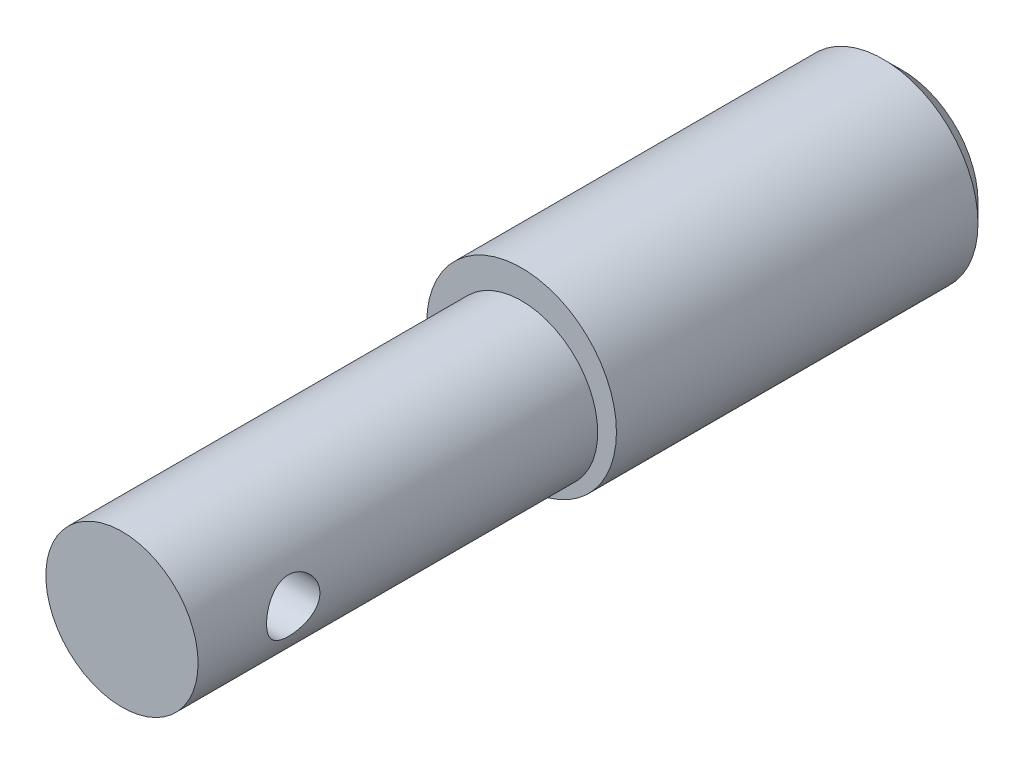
ISO-10303-21;
HEADER;
FILE_DESCRIPTION(('STEP AP214'),'2;1');
FILE_NAME('part.step','',(''),(''),'','','');
FILE_SCHEMA(('AUTOMOTIVE_DESIGN { 1 0 10303 214 1 1 1 1 }'));
ENDSEC;
DATA;
#1=APPLICATION_CONTEXT('core data for automotive mechanical design processes');
#2=APPLICATION_PROTOCOL_DEFINITION('international standard','automotive_design',2000,#1);
#3=PRODUCT_CONTEXT('',#1,'mechanical');
#4=PRODUCT('Part','Part','',(#3));
#5=PRODUCT_RELATED_PRODUCT_CATEGORY('part','',(#4));
#6=PRODUCT_DEFINITION_FORMATION('','',#4);
#7=PRODUCT_DEFINITION_CONTEXT('part definition',#1,'design');
#8=PRODUCT_DEFINITION('design','',#6,#7);
#9=PRODUCT_DEFINITION_SHAPE('','',#8);
#10=(LENGTH_UNIT() NAMED_UNIT(*) SI_UNIT(.MILLI.,.METRE.));
#11=(NAMED_UNIT(*) PLANE_ANGLE_UNIT() SI_UNIT($,.RADIAN.));
#12=(NAMED_UNIT(*) SI_UNIT($,.STERADIAN.) SOLID_ANGLE_UNIT());
#13=UNCERTAINTY_MEASURE_WITH_UNIT(LENGTH_MEASURE(1.E-05),#10,'distance_accuracy_value','');
#14=(GEOMETRIC_REPRESENTATION_CONTEXT(3) GLOBAL_UNCERTAINTY_ASSIGNED_CONTEXT((#13)) GLOBAL_UNIT_ASSIGNED_CONTEXT((#10,
#11,#12)) REPRESENTATION_CONTEXT('',''));
#15=CARTESIAN_POINT('',(0.,0.,0.));
#16=DIRECTION('',(0.,0.,1.));
#17=DIRECTION('',(1.,0.,0.));
#18=AXIS2_PLACEMENT_3D('',#15,#16,#17);
#19=CARTESIAN_POINT('',(0.,0.,16.271875));
#20=DIRECTION('',(0.,0.,-1.));
#21=DIRECTION('',(-1.,0.,0.));
#22=AXIS2_PLACEMENT_3D('',#19,#20,#21);
#23=CYLINDRICAL_SURFACE('',#22,3.95605);
#24=CARTESIAN_POINT('',(0.,0.,-0.396874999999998));
#25=DIRECTION('',(0.,0.,-1.));
#26=DIRECTION('',(-1.,0.,0.));
#27=AXIS2_PLACEMENT_3D('',#24,#25,#26);
#28=CIRCLE('',#27,3.95605);
#29=CARTESIAN_POINT('',(-3.95605,0.,-0.396874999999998));
#30=VERTEX_POINT('',#29);
#31=EDGE_CURVE('E54',#30,#30,#28,.T.);
#32=ORIENTED_EDGE('',*,*,#31,.T.);
#33=EDGE_LOOP('',(#32));
#34=FACE_BOUND('',#33,.T.);
#35=CARTESIAN_POINT('',(0.,0.,-15.478125));
#36=DIRECTION('',(0.,0.,1.));
#37=DIRECTION('',(1.,0.,0.));
#38=AXIS2_PLACEMENT_3D('',#35,#36,#37);
#39=CIRCLE('',#38,3.95605);
#40=CARTESIAN_POINT('',(3.95605,0.,-15.478125));
#41=VERTEX_POINT('',#40);
#42=EDGE_CURVE('E49',#41,#41,#39,.T.);
#43=ORIENTED_EDGE('',*,*,#42,.T.);
#44=EDGE_LOOP('',(#43));
#45=FACE_BOUND('',#44,.T.);
#46=ADVANCED_FACE('F36',(#34,#45),#23,.T.);
#47=CARTESIAN_POINT('',(0.,0.,-16.271875));
#48=DIRECTION('',(0.,0.,1.));
#49=DIRECTION('',(1.,0.,0.));
#50=AXIS2_PLACEMENT_3D('',#47,#48,#49);
#51=PLANE('',#50);
#52=CARTESIAN_POINT('',(0.,0.,-16.271875));
#53=DIRECTION('',(0.,0.,1.));
#54=DIRECTION('',(1.,0.,0.));
#55=AXIS2_PLACEMENT_3D('',#52,#53,#54);
#56=CIRCLE('',#55,3.16229999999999);
#57=CARTESIAN_POINT('',(3.16229999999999,0.,-16.271875));
#58=VERTEX_POINT('',#57);
#59=EDGE_CURVE('E11',#58,#58,#56,.F.);
#60=ORIENTED_EDGE('',*,*,#59,.T.);
#61=EDGE_LOOP('',(#60));
#62=FACE_BOUND('',#61,.T.);
#63=ADVANCED_FACE('F83',(#62),#51,.F.);
#64=CARTESIAN_POINT('',(0.,0.,-15.478125));
#65=DIRECTION('',(0.,0.,1.));
#66=DIRECTION('',(1.,0.,0.));
#67=AXIS2_PLACEMENT_3D('',#64,#65,#66);
#68=CONICAL_SURFACE('',#67,3.95605,0.785398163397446);
#69=ORIENTED_EDGE('',*,*,#59,.F.);
#70=EDGE_LOOP('',(#69));
#71=FACE_BOUND('',#70,.T.);
#72=ORIENTED_EDGE('',*,*,#42,.F.);
#73=EDGE_LOOP('',(#72));
#74=FACE_BOUND('',#73,.T.);
#75=ADVANCED_FACE('F38',(#71,#74),#68,.T.);
#76=CARTESIAN_POINT('',(0.,3.95605,-0.396874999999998));
#77=DIRECTION('',(0.,0.,-1.));
#78=DIRECTION('',(-1.,0.,0.));
#79=AXIS2_PLACEMENT_3D('',#76,#77,#78);
#80=PLANE('',#79);
#81=CARTESIAN_POINT('',(0.,-0.4064,-0.396874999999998));
#82=DIRECTION('',(0.,0.,1.));
#83=DIRECTION('',(1.,0.,0.));
#84=AXIS2_PLACEMENT_3D('',#81,#82,#83);
#85=CIRCLE('',#84,3.175);
#86=CARTESIAN_POINT('',(3.175,-0.4064,-0.396874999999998));
#87=VERTEX_POINT('',#86);
#88=EDGE_CURVE('E59',#87,#87,#85,.T.);
#89=ORIENTED_EDGE('',*,*,#88,.F.);
#90=EDGE_LOOP('',(#89));
#91=FACE_BOUND('',#90,.T.);
#92=ORIENTED_EDGE('',*,*,#31,.F.);
#93=EDGE_LOOP('',(#92));
#94=FACE_BOUND('',#93,.T.);
#95=ADVANCED_FACE('F92',(#91,#94),#80,.F.);
#96=CARTESIAN_POINT('',(0.,-0.4064,13.5155963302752));
#97=DIRECTION('',(0.,0.,1.));
#98=DIRECTION('',(1.,0.,0.));
#99=AXIS2_PLACEMENT_3D('',#96,#97,#98);
#100=CYLINDRICAL_SURFACE('',#99,3.175);
#101=CARTESIAN_POINT('',(3.175,-0.4064,11.1909716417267));
#102=CARTESIAN_POINT('',(3.17500066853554,-0.345895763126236,11.1909706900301));
#103=CARTESIAN_POINT('',(3.17325490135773,-0.285398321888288,11.1959248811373));
#104=CARTESIAN_POINT('',(3.16646357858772,-0.166195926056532,11.215542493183));
#105=CARTESIAN_POINT('',(3.16141801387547,-0.107490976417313,11.2302059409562));
#106=CARTESIAN_POINT('',(3.14857274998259,0.00639074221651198,11.2686703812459));
#107=CARTESIAN_POINT('',(3.14077794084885,0.0615735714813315,11.2924551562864));
#108=CARTESIAN_POINT('',(3.12322210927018,0.167165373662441,11.3484101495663));
#109=CARTESIAN_POINT('',(3.11346063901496,0.217573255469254,11.3805822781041));
#110=CARTESIAN_POINT('',(3.09257883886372,0.314088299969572,11.4536723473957));
#111=CARTESIAN_POINT('',(3.08142355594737,0.359990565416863,11.4948507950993));
#112=CARTESIAN_POINT('',(3.05919544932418,0.44439780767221,11.5842311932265));
#113=CARTESIAN_POINT('',(3.04812264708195,0.482900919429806,11.6324349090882));
#114=CARTESIAN_POINT('',(3.02692009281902,0.552638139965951,11.7364037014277));
#115=CARTESIAN_POINT('',(3.01683242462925,0.583596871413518,11.7923629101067));
#116=CARTESIAN_POINT('',(2.99927864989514,0.635574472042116,11.9091037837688));
#117=CARTESIAN_POINT('',(2.99181164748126,0.656596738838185,11.969883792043));
#118=CARTESIAN_POINT('',(2.98071488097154,0.687319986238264,12.0921981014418));
#119=CARTESIAN_POINT('',(2.9769544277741,0.697407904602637,12.1536229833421));
#120=CARTESIAN_POINT('',(2.97331146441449,0.707186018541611,12.2773998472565));
#121=CARTESIAN_POINT('',(2.97342760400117,0.706879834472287,12.3397514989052));
#122=CARTESIAN_POINT('',(2.97741089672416,0.696177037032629,12.4602211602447));
#123=CARTESIAN_POINT('',(2.98108587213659,0.68629737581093,12.5183925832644));
#124=CARTESIAN_POINT('',(2.99145635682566,0.65757583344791,12.6321928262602));
#125=CARTESIAN_POINT('',(2.99815226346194,0.638732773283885,12.6878213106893));
#126=CARTESIAN_POINT('',(3.01393852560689,0.592302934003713,12.7960829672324));
#127=CARTESIAN_POINT('',(3.02306827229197,0.564570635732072,12.8486477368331));
#128=CARTESIAN_POINT('',(3.04267834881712,0.501250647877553,12.948535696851));
#129=CARTESIAN_POINT('',(3.05315909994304,0.465660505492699,12.9958572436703));
#130=CARTESIAN_POINT('',(3.07503338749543,0.385198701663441,13.08680395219));
#131=CARTESIAN_POINT('',(3.08644459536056,0.339908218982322,13.1300551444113));
#132=CARTESIAN_POINT('',(3.10836554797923,0.242579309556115,13.2084514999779));
#133=CARTESIAN_POINT('',(3.1188751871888,0.190540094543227,13.2435957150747));
#134=CARTESIAN_POINT('',(3.13797296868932,0.0803348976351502,13.3051242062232));
#135=CARTESIAN_POINT('',(3.14653664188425,0.022103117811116,13.331398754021));
#136=CARTESIAN_POINT('',(3.16059865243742,-0.0983269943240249,13.3736594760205));
#137=CARTESIAN_POINT('',(3.16609817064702,-0.160523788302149,13.3896496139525));
#138=CARTESIAN_POINT('',(3.17321186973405,-0.283959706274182,13.4102029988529));
#139=CARTESIAN_POINT('',(3.17499748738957,-0.345105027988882,13.4152708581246));
#140=CARTESIAN_POINT('',(3.17500250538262,-0.467390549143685,13.4152858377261));
#141=CARTESIAN_POINT('',(3.17322257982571,-0.528530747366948,13.4102348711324));
#142=CARTESIAN_POINT('',(3.16640981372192,-0.646987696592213,13.3905491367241));
#143=CARTESIAN_POINT('',(3.1614849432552,-0.704364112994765,13.3762322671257));
#144=CARTESIAN_POINT('',(3.14898536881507,-0.81587100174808,13.338826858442));
#145=CARTESIAN_POINT('',(3.14141032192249,-0.870001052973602,13.3157371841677));
#146=CARTESIAN_POINT('',(3.12411016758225,-0.975153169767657,13.260738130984));
#147=CARTESIAN_POINT('',(3.11433132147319,-1.0260476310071,13.228602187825));
#148=CARTESIAN_POINT('',(3.09372246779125,-1.12188088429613,13.1566846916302));
#149=CARTESIAN_POINT('',(3.08289211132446,-1.16681768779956,13.1169005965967));
#150=CARTESIAN_POINT('',(3.0607046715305,-1.25182272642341,13.0284484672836));
#151=CARTESIAN_POINT('',(3.04934856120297,-1.29153128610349,12.979433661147));
#152=CARTESIAN_POINT('',(3.02793851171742,-1.36221462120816,12.8751987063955));
#153=CARTESIAN_POINT('',(3.0178846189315,-1.39318908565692,12.8199783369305));
#154=CARTESIAN_POINT('',(3.00029780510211,-1.44543921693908,12.7047269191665));
#155=CARTESIAN_POINT('',(2.99276503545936,-1.46671430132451,12.6446955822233));
#156=CARTESIAN_POINT('',(2.98122687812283,-1.49874001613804,12.5215720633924));
#157=CARTESIAN_POINT('',(2.97721967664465,-1.5094960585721,12.4584814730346));
#158=CARTESIAN_POINT('',(2.97340669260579,-1.51973035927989,12.334870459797));
#159=CARTESIAN_POINT('',(2.97337616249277,-1.51981190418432,12.274406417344));
#160=CARTESIAN_POINT('',(2.97695615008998,-1.51020377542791,12.1543752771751));
#161=CARTESIAN_POINT('',(2.9805664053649,-1.50051480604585,12.0948081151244));
#162=CARTESIAN_POINT('',(2.99084566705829,-1.47208569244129,11.9796486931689));
#163=CARTESIAN_POINT('',(2.99744178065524,-1.45356071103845,11.9239962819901));
#164=CARTESIAN_POINT('',(3.01291616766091,-1.40816518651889,11.816549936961));
#165=CARTESIAN_POINT('',(3.02179497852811,-1.3812926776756,11.7647569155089));
#166=CARTESIAN_POINT('',(3.04135727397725,-1.31848553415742,11.6638423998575));
#167=CARTESIAN_POINT('',(3.05210623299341,-1.28218253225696,11.6149629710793));
#168=CARTESIAN_POINT('',(3.07394393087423,-1.20214652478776,11.5237956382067));
#169=CARTESIAN_POINT('',(3.08503276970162,-1.15841131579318,11.4815096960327));
#170=CARTESIAN_POINT('',(3.10689632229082,-1.0624079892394,11.4028142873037));
#171=CARTESIAN_POINT('',(3.11763481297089,-1.00984574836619,11.3667521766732));
#172=CARTESIAN_POINT('',(3.13705096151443,-0.899040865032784,11.3040044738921));
#173=CARTESIAN_POINT('',(3.14572888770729,-0.840798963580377,11.2773176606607));
#174=CARTESIAN_POINT('',(3.15995884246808,-0.720868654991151,11.2344782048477));
#175=CARTESIAN_POINT('',(3.16554201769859,-0.659221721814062,11.2182203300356));
#176=CARTESIAN_POINT('',(3.17306159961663,-0.533846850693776,11.1964694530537));
#177=CARTESIAN_POINT('',(3.174999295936,-0.470119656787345,11.190972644));
#178=CARTESIAN_POINT('',(3.175,-0.4064,11.1909716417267));
#179=B_SPLINE_CURVE_WITH_KNOTS('',3,(#101,#102,#103,#104,#105,#106,#107,#108,#109,#110,#111,
#112,#113,#114,#115,#116,#117,#118,#119,#120,#121,#122,#123,#124,#125,#126,#127,#128,#129,#130,
#131,#132,#133,#134,#135,#136,#137,#138,#139,#140,#141,#142,#143,#144,#145,#146,#147,#148,#149,
#150,#151,#152,#153,#154,#155,#156,#157,#158,#159,#160,#161,#162,#163,#164,#165,#166,#167,#168,
#169,#170,#171,#172,#173,#174,#175,#176,#177,#178),.UNSPECIFIED.,.T.,.F.,(4,2,2,2,2,2,2,2,2,2,2,
2,2,2,2,2,2,2,2,2,2,2,2,2,2,2,2,2,2,2,2,2,2,2,2,2,2,2,4),(0.,0.181278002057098,
0.362556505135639,0.54351418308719,0.724513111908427,0.911675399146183,1.09888480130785,
1.29214909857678,1.48534726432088,1.67145977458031,1.85750746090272,2.03403833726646,
2.21059244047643,2.39019858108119,2.56986086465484,2.75995117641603,2.95006371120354,
3.14244865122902,3.33475939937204,3.51797588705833,3.70115773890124,3.87836604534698,
4.05559729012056,4.23773725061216,4.41993785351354,4.61132433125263,4.80271762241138,
4.99412240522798,5.18542865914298,5.3659179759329,5.54639428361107,5.72268428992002,
5.89901584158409,6.0836838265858,6.26840665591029,6.46139015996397,6.65434851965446,
6.84532788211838,7.03623967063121),.UNSPECIFIED.);
#180=CARTESIAN_POINT('',(3.175,-0.4064,11.1909716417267));
#181=VERTEX_POINT('',#180);
#182=EDGE_CURVE('E40',#181,#181,#179,.T.);
#183=ORIENTED_EDGE('',*,*,#182,.F.);
#184=EDGE_LOOP('',(#183));
#185=FACE_BOUND('',#184,.T.);
#186=CARTESIAN_POINT('',(-3.175,-0.4064,11.1909716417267));
#187=CARTESIAN_POINT('',(-3.17500066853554,-0.466904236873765,11.1909706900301));
#188=CARTESIAN_POINT('',(-3.17325490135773,-0.527401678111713,11.1959248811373));
#189=CARTESIAN_POINT('',(-3.16646357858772,-0.646604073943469,11.215542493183));
#190=CARTESIAN_POINT('',(-3.16141801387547,-0.705309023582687,11.2302059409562));
#191=CARTESIAN_POINT('',(-3.14857274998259,-0.819190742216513,11.2686703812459));
#192=CARTESIAN_POINT('',(-3.14077794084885,-0.874373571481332,11.2924551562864));
#193=CARTESIAN_POINT('',(-3.12322210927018,-0.979965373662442,11.3484101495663));
#194=CARTESIAN_POINT('',(-3.11346063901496,-1.03037325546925,11.3805822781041));
#195=CARTESIAN_POINT('',(-3.09257883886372,-1.12688829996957,11.4536723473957));
#196=CARTESIAN_POINT('',(-3.08142355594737,-1.17279056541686,11.4948507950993));
#197=CARTESIAN_POINT('',(-3.05919544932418,-1.25719780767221,11.5842311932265));
#198=CARTESIAN_POINT('',(-3.04812264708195,-1.29570091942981,11.6324349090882));
#199=CARTESIAN_POINT('',(-3.02692009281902,-1.36543813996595,11.7364037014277));
#200=CARTESIAN_POINT('',(-3.01683242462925,-1.39639687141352,11.7923629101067));
#201=CARTESIAN_POINT('',(-2.99927864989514,-1.44837447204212,11.9091037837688));
#202=CARTESIAN_POINT('',(-2.99181164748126,-1.46939673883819,11.969883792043));
#203=CARTESIAN_POINT('',(-2.98071488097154,-1.50011998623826,12.0921981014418));
#204=CARTESIAN_POINT('',(-2.9769544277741,-1.51020790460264,12.1536229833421));
#205=CARTESIAN_POINT('',(-2.97331146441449,-1.51998601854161,12.2773998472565));
#206=CARTESIAN_POINT('',(-2.97342760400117,-1.51967983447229,12.3397514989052));
#207=CARTESIAN_POINT('',(-2.97741089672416,-1.50897703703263,12.4602211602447));
#208=CARTESIAN_POINT('',(-2.98108587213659,-1.49909737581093,12.5183925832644));
#209=CARTESIAN_POINT('',(-2.99145635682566,-1.47037583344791,12.6321928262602));
#210=CARTESIAN_POINT('',(-2.99815226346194,-1.45153277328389,12.6878213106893));
#211=CARTESIAN_POINT('',(-3.01393852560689,-1.40510293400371,12.7960829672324));
#212=CARTESIAN_POINT('',(-3.02306827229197,-1.37737063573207,12.8486477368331));
#213=CARTESIAN_POINT('',(-3.04267834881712,-1.31405064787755,12.948535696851));
#214=CARTESIAN_POINT('',(-3.05315909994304,-1.2784605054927,12.9958572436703));
#215=CARTESIAN_POINT('',(-3.07503338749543,-1.19799870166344,13.08680395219));
#216=CARTESIAN_POINT('',(-3.08644459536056,-1.15270821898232,13.1300551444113));
#217=CARTESIAN_POINT('',(-3.10836554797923,-1.05537930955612,13.2084514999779));
#218=CARTESIAN_POINT('',(-3.1188751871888,-1.00334009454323,13.2435957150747));
#219=CARTESIAN_POINT('',(-3.13797296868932,-0.893134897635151,13.3051242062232));
#220=CARTESIAN_POINT('',(-3.14653664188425,-0.834903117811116,13.331398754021));
#221=CARTESIAN_POINT('',(-3.16059865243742,-0.714473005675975,13.3736594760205));
#222=CARTESIAN_POINT('',(-3.16609817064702,-0.652276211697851,13.3896496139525));
#223=CARTESIAN_POINT('',(-3.17321186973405,-0.528840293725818,13.4102029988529));
#224=CARTESIAN_POINT('',(-3.17499748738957,-0.467694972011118,13.4152708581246));
#225=CARTESIAN_POINT('',(-3.17500250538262,-0.345409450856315,13.4152858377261));
#226=CARTESIAN_POINT('',(-3.17322257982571,-0.284269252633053,13.4102348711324));
#227=CARTESIAN_POINT('',(-3.16640981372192,-0.165812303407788,13.3905491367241));
#228=CARTESIAN_POINT('',(-3.1614849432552,-0.108435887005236,13.3762322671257));
#229=CARTESIAN_POINT('',(-3.14898536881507,0.00307100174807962,13.338826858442));
#230=CARTESIAN_POINT('',(-3.14141032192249,0.0572010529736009,13.3157371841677));
#231=CARTESIAN_POINT('',(-3.12411016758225,0.162353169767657,13.260738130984));
#232=CARTESIAN_POINT('',(-3.11433132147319,0.213247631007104,13.228602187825));
#233=CARTESIAN_POINT('',(-3.09372246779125,0.309080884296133,13.1566846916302));
#234=CARTESIAN_POINT('',(-3.08289211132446,0.354017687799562,13.1169005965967));
#235=CARTESIAN_POINT('',(-3.0607046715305,0.439022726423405,13.0284484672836));
#236=CARTESIAN_POINT('',(-3.04934856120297,0.478731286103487,12.979433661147));
#237=CARTESIAN_POINT('',(-3.02793851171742,0.549414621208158,12.8751987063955));
#238=CARTESIAN_POINT('',(-3.0178846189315,0.580389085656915,12.8199783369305));
#239=CARTESIAN_POINT('',(-3.00029780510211,0.63263921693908,12.7047269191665));
#240=CARTESIAN_POINT('',(-2.99276503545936,0.653914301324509,12.6446955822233));
#241=CARTESIAN_POINT('',(-2.98122687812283,0.685940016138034,12.5215720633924));
#242=CARTESIAN_POINT('',(-2.97721967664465,0.696696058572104,12.4584814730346));
#243=CARTESIAN_POINT('',(-2.97340669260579,0.706930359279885,12.334870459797));
#244=CARTESIAN_POINT('',(-2.97337616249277,0.707011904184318,12.274406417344));
#245=CARTESIAN_POINT('',(-2.97695615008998,0.697403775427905,12.1543752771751));
#246=CARTESIAN_POINT('',(-2.9805664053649,0.687714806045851,12.0948081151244));
#247=CARTESIAN_POINT('',(-2.99084566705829,0.659285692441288,11.9796486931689));
#248=CARTESIAN_POINT('',(-2.99744178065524,0.64076071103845,11.9239962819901));
#249=CARTESIAN_POINT('',(-3.01291616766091,0.595365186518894,11.816549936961));
#250=CARTESIAN_POINT('',(-3.02179497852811,0.568492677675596,11.7647569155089));
#251=CARTESIAN_POINT('',(-3.04135727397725,0.50568553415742,11.6638423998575));
#252=CARTESIAN_POINT('',(-3.05210623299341,0.46938253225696,11.6149629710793));
#253=CARTESIAN_POINT('',(-3.07394393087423,0.38934652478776,11.5237956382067));
#254=CARTESIAN_POINT('',(-3.08503276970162,0.345611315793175,11.4815096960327));
#255=CARTESIAN_POINT('',(-3.10689632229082,0.2496079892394,11.4028142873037));
#256=CARTESIAN_POINT('',(-3.11763481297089,0.197045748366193,11.3667521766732));
#257=CARTESIAN_POINT('',(-3.13705096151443,0.0862408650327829,11.3040044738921));
#258=CARTESIAN_POINT('',(-3.14572888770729,0.0279989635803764,11.2773176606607));
#259=CARTESIAN_POINT('',(-3.15995884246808,-0.0919313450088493,11.2344782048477));
#260=CARTESIAN_POINT('',(-3.16554201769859,-0.153578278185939,11.2182203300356));
#261=CARTESIAN_POINT('',(-3.17306159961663,-0.278953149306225,11.1964694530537));
#262=CARTESIAN_POINT('',(-3.174999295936,-0.342680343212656,11.190972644));
#263=CARTESIAN_POINT('',(-3.175,-0.4064,11.1909716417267));
#264=B_SPLINE_CURVE_WITH_KNOTS('',3,(#186,#187,#188,#189,#190,#191,#192,#193,#194,#195,#196,
#197,#198,#199,#200,#201,#202,#203,#204,#205,#206,#207,#208,#209,#210,#211,#212,#213,#214,#215,
#216,#217,#218,#219,#220,#221,#222,#223,#224,#225,#226,#227,#228,#229,#230,#231,#232,#233,#234,
#235,#236,#237,#238,#239,#240,#241,#242,#243,#244,#245,#246,#247,#248,#249,#250,#251,#252,#253,
#254,#255,#256,#257,#258,#259,#260,#261,#262,#263),.UNSPECIFIED.,.T.,.F.,(4,2,2,2,2,2,2,2,2,2,2,
2,2,2,2,2,2,2,2,2,2,2,2,2,2,2,2,2,2,2,2,2,2,2,2,2,2,2,4),(0.,0.181278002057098,
0.362556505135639,0.54351418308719,0.724513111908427,0.911675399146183,1.09888480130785,
1.29214909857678,1.48534726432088,1.67145977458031,1.85750746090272,2.03403833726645,
2.21059244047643,2.39019858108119,2.56986086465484,2.75995117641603,2.95006371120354,
3.14244865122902,3.33475939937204,3.51797588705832,3.70115773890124,3.87836604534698,
4.05559729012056,4.23773725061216,4.41993785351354,4.61132433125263,4.80271762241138,
4.99412240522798,5.18542865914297,5.3659179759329,5.54639428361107,5.72268428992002,
5.89901584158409,6.0836838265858,6.26840665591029,6.46139015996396,6.65434851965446,
6.84532788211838,7.0362396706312),.UNSPECIFIED.);
#265=CARTESIAN_POINT('',(-3.175,-0.4064,11.1909716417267));
#266=VERTEX_POINT('',#265);
#267=EDGE_CURVE('E60',#266,#266,#264,.T.);
#268=ORIENTED_EDGE('',*,*,#267,.F.);
#269=EDGE_LOOP('',(#268));
#270=FACE_BOUND('',#269,.T.);
#271=ORIENTED_EDGE('',*,*,#88,.T.);
#272=EDGE_LOOP('',(#271));
#273=FACE_BOUND('',#272,.T.);
#274=CARTESIAN_POINT('',(0.,-0.4064,16.271875));
#275=DIRECTION('',(0.,0.,1.));
#276=DIRECTION('',(1.,0.,0.));
#277=AXIS2_PLACEMENT_3D('',#274,#275,#276);
#278=CIRCLE('',#277,3.175);
#279=CARTESIAN_POINT('',(3.175,-0.4064,16.271875));
#280=VERTEX_POINT('',#279);
#281=EDGE_CURVE('E103',#280,#280,#278,.T.);
#282=ORIENTED_EDGE('',*,*,#281,.F.);
#283=EDGE_LOOP('',(#282));
#284=FACE_BOUND('',#283,.T.);
#285=ADVANCED_FACE('F65',(#185,#270,#273,#284),#100,.T.);
#286=CARTESIAN_POINT('',(0.,0.,16.271875));
#287=DIRECTION('',(0.,0.,1.));
#288=DIRECTION('',(1.,0.,0.));
#289=AXIS2_PLACEMENT_3D('',#286,#287,#288);
#290=PLANE('',#289);
#291=ORIENTED_EDGE('',*,*,#281,.T.);
#292=EDGE_LOOP('',(#291));
#293=FACE_BOUND('',#292,.T.);
#294=ADVANCED_FACE('F71',(#293),#290,.T.);
#295=CARTESIAN_POINT('',(-3.95605,-0.4064,12.303125));
#296=DIRECTION('',(1.,0.,0.));
#297=DIRECTION('',(0.,0.,-1.));
#298=AXIS2_PLACEMENT_3D('',#295,#296,#297);
#299=CYLINDRICAL_SURFACE('',#298,1.11215335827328);
#300=ORIENTED_EDGE('',*,*,#182,.T.);
#301=EDGE_LOOP('',(#300));
#302=FACE_BOUND('',#301,.T.);
#303=ORIENTED_EDGE('',*,*,#267,.T.);
#304=EDGE_LOOP('',(#303));
#305=FACE_BOUND('',#304,.T.);
#306=ADVANCED_FACE('F68',(#302,#305),#299,.F.);
#307=CLOSED_SHELL('',(#46,#63,#75,#95,#285,#294,#306));
#308=MANIFOLD_SOLID_BREP('B2',#307);
#309=ADVANCED_BREP_SHAPE_REPRESENTATION('',(#18,#308),#14);
#310=SHAPE_DEFINITION_REPRESENTATION(#9,#309);
ENDSEC;
END-ISO-10303-21;
